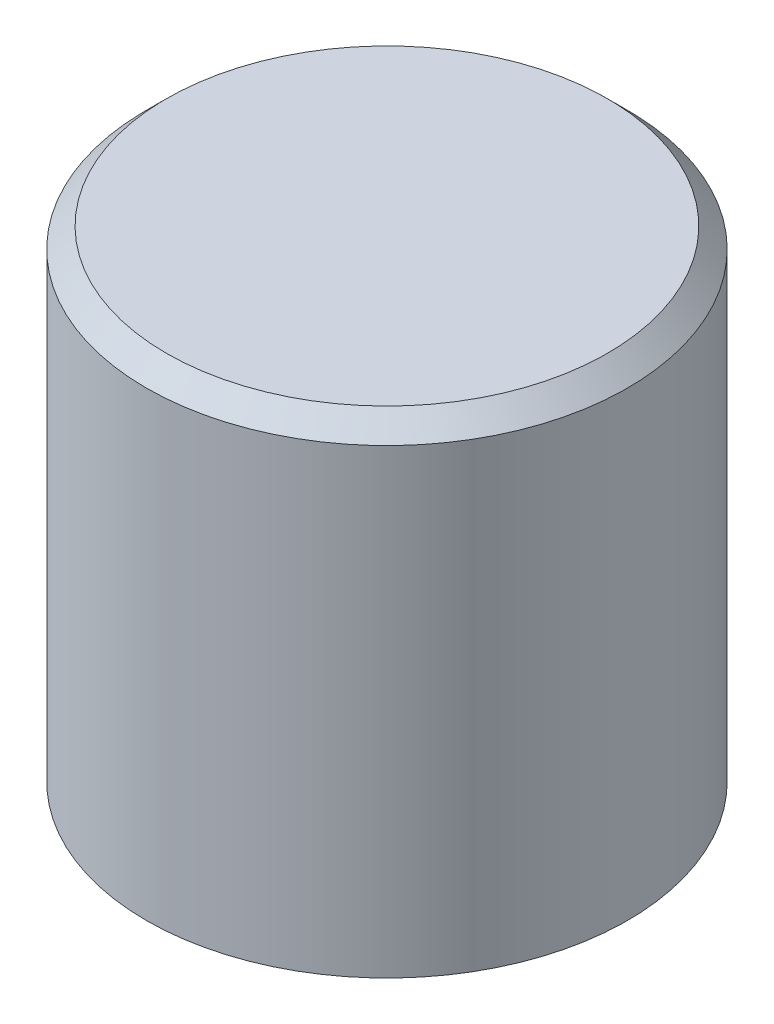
ISO-10303-21;
HEADER;
FILE_DESCRIPTION(('STEP AP214'),'2;1');
FILE_NAME('part.step','',(''),(''),'','','');
FILE_SCHEMA(('AUTOMOTIVE_DESIGN { 1 0 10303 214 1 1 1 1 }'));
ENDSEC;
DATA;
#1=APPLICATION_CONTEXT('core data for automotive mechanical design processes');
#2=APPLICATION_PROTOCOL_DEFINITION('international standard','automotive_design',2000,#1);
#3=PRODUCT_CONTEXT('',#1,'mechanical');
#4=PRODUCT('Part','Part','',(#3));
#5=PRODUCT_RELATED_PRODUCT_CATEGORY('part','',(#4));
#6=PRODUCT_DEFINITION_FORMATION('','',#4);
#7=PRODUCT_DEFINITION_CONTEXT('part definition',#1,'design');
#8=PRODUCT_DEFINITION('design','',#6,#7);
#9=PRODUCT_DEFINITION_SHAPE('','',#8);
#10=(LENGTH_UNIT() NAMED_UNIT(*) SI_UNIT(.MILLI.,.METRE.));
#11=(NAMED_UNIT(*) PLANE_ANGLE_UNIT() SI_UNIT($,.RADIAN.));
#12=(NAMED_UNIT(*) SI_UNIT($,.STERADIAN.) SOLID_ANGLE_UNIT());
#13=UNCERTAINTY_MEASURE_WITH_UNIT(LENGTH_MEASURE(1.E-05),#10,'distance_accuracy_value','');
#14=(GEOMETRIC_REPRESENTATION_CONTEXT(3) GLOBAL_UNCERTAINTY_ASSIGNED_CONTEXT((#13)) GLOBAL_UNIT_ASSIGNED_CONTEXT((#10,
#11,#12)) REPRESENTATION_CONTEXT('',''));
#15=CARTESIAN_POINT('',(0.,0.,0.));
#16=DIRECTION('',(0.,0.,1.));
#17=DIRECTION('',(1.,0.,0.));
#18=AXIS2_PLACEMENT_3D('',#15,#16,#17);
#19=CARTESIAN_POINT('',(0.,12.,0.));
#20=DIRECTION('',(0.,1.,0.));
#21=DIRECTION('',(0.,0.,1.));
#22=AXIS2_PLACEMENT_3D('',#19,#20,#21);
#23=PLANE('',#22);
#24=CARTESIAN_POINT('',(0.,12.,0.));
#25=DIRECTION('',(0.,1.,0.));
#26=DIRECTION('',(0.,0.,1.));
#27=AXIS2_PLACEMENT_3D('',#24,#25,#26);
#28=CIRCLE('',#27,5.50000000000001);
#29=CARTESIAN_POINT('',(0.,12.,5.50000000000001));
#30=VERTEX_POINT('',#29);
#31=EDGE_CURVE('E49',#30,#30,#28,.T.);
#32=ORIENTED_EDGE('',*,*,#31,.T.);
#33=EDGE_LOOP('',(#32));
#34=FACE_BOUND('',#33,.T.);
#35=ADVANCED_FACE('F33',(#34),#23,.T.);
#36=CARTESIAN_POINT('',(0.,0.,0.));
#37=DIRECTION('',(0.,1.,0.));
#38=DIRECTION('',(0.,0.,1.));
#39=AXIS2_PLACEMENT_3D('',#36,#37,#38);
#40=CYLINDRICAL_SURFACE('',#39,6.);
#41=CARTESIAN_POINT('',(0.,11.5,0.));
#42=DIRECTION('',(0.,1.,0.));
#43=DIRECTION('',(0.,0.,1.));
#44=AXIS2_PLACEMENT_3D('',#41,#42,#43);
#45=CIRCLE('',#44,6.);
#46=CARTESIAN_POINT('',(0.,11.5,6.));
#47=VERTEX_POINT('',#46);
#48=EDGE_CURVE('E45',#47,#47,#45,.F.);
#49=ORIENTED_EDGE('',*,*,#48,.T.);
#50=EDGE_LOOP('',(#49));
#51=FACE_BOUND('',#50,.T.);
#52=CARTESIAN_POINT('',(0.,0.,0.));
#53=DIRECTION('',(0.,1.,0.));
#54=DIRECTION('',(0.,0.,1.));
#55=AXIS2_PLACEMENT_3D('',#52,#53,#54);
#56=CIRCLE('',#55,6.);
#57=CARTESIAN_POINT('',(0.,0.,6.));
#58=VERTEX_POINT('',#57);
#59=EDGE_CURVE('E54',#58,#58,#56,.T.);
#60=ORIENTED_EDGE('',*,*,#59,.T.);
#61=EDGE_LOOP('',(#60));
#62=FACE_BOUND('',#61,.T.);
#63=ADVANCED_FACE('F81',(#51,#62),#40,.T.);
#64=CARTESIAN_POINT('',(-6.,0.,0.));
#65=DIRECTION('',(0.,-1.,0.));
#66=DIRECTION('',(0.,0.,-1.));
#67=AXIS2_PLACEMENT_3D('',#64,#65,#66);
#68=PLANE('',#67);
#69=CARTESIAN_POINT('',(0.,0.,0.));
#70=DIRECTION('',(0.,1.,0.));
#71=DIRECTION('',(0.,0.,1.));
#72=AXIS2_PLACEMENT_3D('',#69,#70,#71);
#73=CIRCLE('',#72,5.);
#74=CARTESIAN_POINT('',(0.,0.,5.));
#75=VERTEX_POINT('',#74);
#76=EDGE_CURVE('E57',#75,#75,#73,.T.);
#77=ORIENTED_EDGE('',*,*,#76,.T.);
#78=EDGE_LOOP('',(#77));
#79=FACE_BOUND('',#78,.T.);
#80=ORIENTED_EDGE('',*,*,#59,.F.);
#81=EDGE_LOOP('',(#80));
#82=FACE_BOUND('',#81,.T.);
#83=ADVANCED_FACE('F87',(#79,#82),#68,.T.);
#84=CARTESIAN_POINT('',(0.,0.,0.));
#85=DIRECTION('',(0.,1.,0.));
#86=DIRECTION('',(0.,0.,1.));
#87=AXIS2_PLACEMENT_3D('',#84,#85,#86);
#88=CYLINDRICAL_SURFACE('',#87,5.);
#89=CARTESIAN_POINT('',(0.,3.,0.));
#90=DIRECTION('',(0.,1.,0.));
#91=DIRECTION('',(0.,0.,1.));
#92=AXIS2_PLACEMENT_3D('',#89,#90,#91);
#93=CIRCLE('',#92,5.);
#94=CARTESIAN_POINT('',(0.,3.,-5.));
#95=VERTEX_POINT('',#94);
#96=EDGE_CURVE('E60',#95,#95,#93,.T.);
#97=ORIENTED_EDGE('',*,*,#96,.T.);
#98=EDGE_LOOP('',(#97));
#99=FACE_BOUND('',#98,.T.);
#100=ORIENTED_EDGE('',*,*,#76,.F.);
#101=EDGE_LOOP('',(#100));
#102=FACE_BOUND('',#101,.T.);
#103=ADVANCED_FACE('F98',(#99,#102),#88,.F.);
#104=CARTESIAN_POINT('',(0.,3.,0.));
#105=DIRECTION('',(0.,-1.,0.));
#106=DIRECTION('',(0.,0.,-1.));
#107=AXIS2_PLACEMENT_3D('',#104,#105,#106);
#108=CONICAL_SURFACE('',#107,5.,1.39626340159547);
#109=CARTESIAN_POINT('',(0.,3.59573703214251,0.));
#110=DIRECTION('',(0.,1.,0.));
#111=DIRECTION('',(0.,0.,1.));
#112=AXIS2_PLACEMENT_3D('',#109,#110,#111);
#113=CIRCLE('',#112,1.62140740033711);
#114=CARTESIAN_POINT('',(0.,3.59573703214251,-1.62140740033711));
#115=VERTEX_POINT('',#114);
#116=EDGE_CURVE('E41',#115,#115,#113,.T.);
#117=CARTESIAN_POINT('',(0.,3.59573703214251,-1.62140740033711));
#118=CARTESIAN_POINT('',(0.,3.58953143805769,-1.65660107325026));
#119=CARTESIAN_POINT('',(0.,3.58332584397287,-1.69179474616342));
#120=CARTESIAN_POINT('',(0.,3.57091465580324,-1.76218209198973));
#121=CARTESIAN_POINT('',(0.,3.56470906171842,-1.79737576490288));
#122=CARTESIAN_POINT('',(0.,3.55229787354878,-1.86776311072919));
#123=CARTESIAN_POINT('',(0.,3.54609227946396,-1.90295678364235));
#124=CARTESIAN_POINT('',(0.,3.53368109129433,-1.97334412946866));
#125=CARTESIAN_POINT('',(0.,3.52747549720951,-2.00853780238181));
#126=CARTESIAN_POINT('',(0.,3.51506430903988,-2.07892514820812));
#127=CARTESIAN_POINT('',(0.,3.50885871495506,-2.11411882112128));
#128=CARTESIAN_POINT('',(0.,3.49644752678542,-2.18450616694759));
#129=CARTESIAN_POINT('',(0.,3.4902419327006,-2.21969983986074));
#130=CARTESIAN_POINT('',(0.,3.47783074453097,-2.29008718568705));
#131=CARTESIAN_POINT('',(0.,3.47162515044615,-2.32528085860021));
#132=CARTESIAN_POINT('',(0.,3.45921396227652,-2.39566820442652));
#133=CARTESIAN_POINT('',(0.,3.4530083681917,-2.43086187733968));
#134=CARTESIAN_POINT('',(0.,3.44059718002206,-2.50124922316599));
#135=CARTESIAN_POINT('',(0.,3.43439158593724,-2.53644289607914));
#136=CARTESIAN_POINT('',(0.,3.42198039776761,-2.60683024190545));
#137=CARTESIAN_POINT('',(0.,3.41577480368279,-2.64202391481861));
#138=CARTESIAN_POINT('',(0.,3.40336361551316,-2.71241126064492));
#139=CARTESIAN_POINT('',(0.,3.39715802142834,-2.74760493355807));
#140=CARTESIAN_POINT('',(0.,3.3847468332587,-2.81799227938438));
#141=CARTESIAN_POINT('',(0.,3.37854123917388,-2.85318595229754));
#142=CARTESIAN_POINT('',(0.,3.36613005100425,-2.92357329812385));
#143=CARTESIAN_POINT('',(0.,3.35992445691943,-2.958766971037));
#144=CARTESIAN_POINT('',(0.,3.3475132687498,-3.02915431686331));
#145=CARTESIAN_POINT('',(0.,3.34130767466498,-3.06434798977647));
#146=CARTESIAN_POINT('',(0.,3.32889648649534,-3.13473533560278));
#147=CARTESIAN_POINT('',(0.,3.32269089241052,-3.16992900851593));
#148=CARTESIAN_POINT('',(0.,3.31027970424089,-3.24031635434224));
#149=CARTESIAN_POINT('',(0.,3.30407411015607,-3.2755100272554));
#150=CARTESIAN_POINT('',(0.,3.29166292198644,-3.34589737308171));
#151=CARTESIAN_POINT('',(0.,3.28545732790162,-3.38109104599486));
#152=CARTESIAN_POINT('',(0.,3.27304613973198,-3.45147839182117));
#153=CARTESIAN_POINT('',(0.,3.26684054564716,-3.48667206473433));
#154=CARTESIAN_POINT('',(0.,3.25442935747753,-3.55705941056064));
#155=CARTESIAN_POINT('',(0.,3.24822376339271,-3.5922530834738));
#156=CARTESIAN_POINT('',(0.,3.23581257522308,-3.66264042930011));
#157=CARTESIAN_POINT('',(0.,3.22960698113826,-3.69783410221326));
#158=CARTESIAN_POINT('',(0.,3.21719579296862,-3.76822144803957));
#159=CARTESIAN_POINT('',(0.,3.2109901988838,-3.80341512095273));
#160=CARTESIAN_POINT('',(0.,3.19857901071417,-3.87380246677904));
#161=CARTESIAN_POINT('',(0.,3.19237341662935,-3.90899613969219));
#162=CARTESIAN_POINT('',(0.,3.17996222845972,-3.9793834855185));
#163=CARTESIAN_POINT('',(0.,3.1737566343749,-4.01457715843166));
#164=CARTESIAN_POINT('',(0.,3.16134544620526,-4.08496450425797));
#165=CARTESIAN_POINT('',(0.,3.15513985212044,-4.12015817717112));
#166=CARTESIAN_POINT('',(0.,3.14272866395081,-4.19054552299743));
#167=CARTESIAN_POINT('',(0.,3.13652306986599,-4.22573919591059));
#168=CARTESIAN_POINT('',(0.,3.12411188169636,-4.2961265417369));
#169=CARTESIAN_POINT('',(0.,3.11790628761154,-4.33132021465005));
#170=CARTESIAN_POINT('',(0.,3.1054950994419,-4.40170756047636));
#171=CARTESIAN_POINT('',(0.,3.09928950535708,-4.43690123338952));
#172=CARTESIAN_POINT('',(0.,3.08687831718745,-4.50728857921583));
#173=CARTESIAN_POINT('',(0.,3.08067272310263,-4.54248225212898));
#174=CARTESIAN_POINT('',(0.,3.068261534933,-4.61286959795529));
#175=CARTESIAN_POINT('',(0.,3.06205594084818,-4.64806327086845));
#176=CARTESIAN_POINT('',(0.,3.04964475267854,-4.71845061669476));
#177=CARTESIAN_POINT('',(0.,3.04343915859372,-4.75364428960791));
#178=CARTESIAN_POINT('',(0.,3.03102797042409,-4.82403163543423));
#179=CARTESIAN_POINT('',(0.,3.02482237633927,-4.85922530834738));
#180=CARTESIAN_POINT('',(0.,3.01241118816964,-4.92961265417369));
#181=CARTESIAN_POINT('',(0.,3.00620559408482,-4.96480632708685));
#182=CARTESIAN_POINT('',(0.,3.,-5.));
#183=B_SPLINE_CURVE_WITH_KNOTS('',3,(#117,#118,#119,#120,#121,#122,#123,#124,#125,#126,#127,
#128,#129,#130,#131,#132,#133,#134,#135,#136,#137,#138,#139,#140,#141,#142,#143,#144,#145,#146,
#147,#148,#149,#150,#151,#152,#153,#154,#155,#156,#157,#158,#159,#160,#161,#162,#163,#164,#165,
#166,#167,#168,#169,#170,#171,#172,#173,#174,#175,#176,#177,#178,#179,#180,#181,#182),
.UNSPECIFIED.,.F.,.F.,(4,2,2,2,2,2,2,2,2,2,2,2,2,2,2,2,2,2,2,2,2,2,2,2,2,2,2,2,2,2,2,2,4),(0.,
0.107209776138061,0.214419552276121,0.321629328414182,0.428839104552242,0.536048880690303,
0.643258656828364,0.750468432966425,0.857678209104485,0.964887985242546,1.07209776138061,
1.17930753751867,1.28651731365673,1.39372708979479,1.50093686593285,1.60814664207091,
1.71535641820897,1.82256619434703,1.92977597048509,2.03698574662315,2.14419552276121,
2.25140529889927,2.35861507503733,2.4658248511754,2.57303462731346,2.68024440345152,
2.78745417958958,2.89466395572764,3.0018737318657,3.10908350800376,3.21629328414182,
3.32350306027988,3.43071283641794),.UNSPECIFIED.);
#184=EDGE_CURVE('BSEAM78',#115,#95,#183,.T.);
#185=ORIENTED_EDGE('',*,*,#116,.T.);
#186=ORIENTED_EDGE('',*,*,#96,.F.);
#187=ORIENTED_EDGE('',*,*,#184,.T.);
#188=ORIENTED_EDGE('',*,*,#184,.F.);
#189=EDGE_LOOP('',(#185,#187,#186,#188));
#190=FACE_BOUND('',#189,.T.);
#191=ADVANCED_FACE('F78',(#190),#108,.F.);
#192=CARTESIAN_POINT('',(0.,0.,0.));
#193=DIRECTION('',(0.,1.,0.));
#194=DIRECTION('',(0.,0.,1.));
#195=AXIS2_PLACEMENT_3D('',#192,#193,#194);
#196=CYLINDRICAL_SURFACE('',#195,1.5);
#197=CARTESIAN_POINT('',(0.,3.71714443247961,0.));
#198=DIRECTION('',(0.,-1.,0.));
#199=DIRECTION('',(0.,0.,-1.));
#200=AXIS2_PLACEMENT_3D('',#197,#198,#199);
#201=CIRCLE('',#200,1.5);
#202=CARTESIAN_POINT('',(0.,3.71714443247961,-1.5));
#203=VERTEX_POINT('',#202);
#204=EDGE_CURVE('E10',#203,#203,#201,.T.);
#205=ORIENTED_EDGE('',*,*,#204,.T.);
#206=EDGE_LOOP('',(#205));
#207=FACE_BOUND('',#206,.T.);
#208=CARTESIAN_POINT('',(0.,8.5,0.));
#209=DIRECTION('',(0.,1.,0.));
#210=DIRECTION('',(0.,0.,1.));
#211=AXIS2_PLACEMENT_3D('',#208,#209,#210);
#212=CIRCLE('',#211,1.5);
#213=CARTESIAN_POINT('',(0.,8.5,1.5));
#214=VERTEX_POINT('',#213);
#215=EDGE_CURVE('E63',#214,#214,#212,.T.);
#216=ORIENTED_EDGE('',*,*,#215,.T.);
#217=EDGE_LOOP('',(#216));
#218=FACE_BOUND('',#217,.T.);
#219=ADVANCED_FACE('F67',(#207,#218),#196,.F.);
#220=CARTESIAN_POINT('',(-1.5,8.5,0.));
#221=DIRECTION('',(0.,-1.,0.));
#222=DIRECTION('',(0.,0.,-1.));
#223=AXIS2_PLACEMENT_3D('',#220,#221,#222);
#224=PLANE('',#223);
#225=ORIENTED_EDGE('',*,*,#215,.F.);
#226=EDGE_LOOP('',(#225));
#227=FACE_BOUND('',#226,.T.);
#228=ADVANCED_FACE('F69',(#227),#224,.T.);
#229=CARTESIAN_POINT('',(0.,12.,0.));
#230=DIRECTION('',(0.,-1.,0.));
#231=DIRECTION('',(0.,0.,-1.));
#232=AXIS2_PLACEMENT_3D('',#229,#230,#231);
#233=CONICAL_SURFACE('',#232,5.50000000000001,0.78539816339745);
#234=ORIENTED_EDGE('',*,*,#48,.F.);
#235=EDGE_LOOP('',(#234));
#236=FACE_BOUND('',#235,.T.);
#237=ORIENTED_EDGE('',*,*,#31,.F.);
#238=EDGE_LOOP('',(#237));
#239=FACE_BOUND('',#238,.T.);
#240=ADVANCED_FACE('F71',(#236,#239),#233,.T.);
#241=CARTESIAN_POINT('',(0.,3.59573703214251,0.));
#242=DIRECTION('',(0.,-1.,0.));
#243=DIRECTION('',(0.,0.,-1.));
#244=AXIS2_PLACEMENT_3D('',#241,#242,#243);
#245=CONICAL_SURFACE('',#244,1.62140740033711,0.785398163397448);
#246=ORIENTED_EDGE('',*,*,#204,.F.);
#247=EDGE_LOOP('',(#246));
#248=FACE_BOUND('',#247,.T.);
#249=ORIENTED_EDGE('',*,*,#116,.F.);
#250=EDGE_LOOP('',(#249));
#251=FACE_BOUND('',#250,.T.);
#252=ADVANCED_FACE('F36',(#248,#251),#245,.F.);
#253=CLOSED_SHELL('',(#35,#63,#83,#103,#191,#219,#228,#240,#252));
#254=MANIFOLD_SOLID_BREP('B2',#253);
#255=ADVANCED_BREP_SHAPE_REPRESENTATION('',(#18,#254),#14);
#256=SHAPE_DEFINITION_REPRESENTATION(#9,#255);
ENDSEC;
END-ISO-10303-21;
